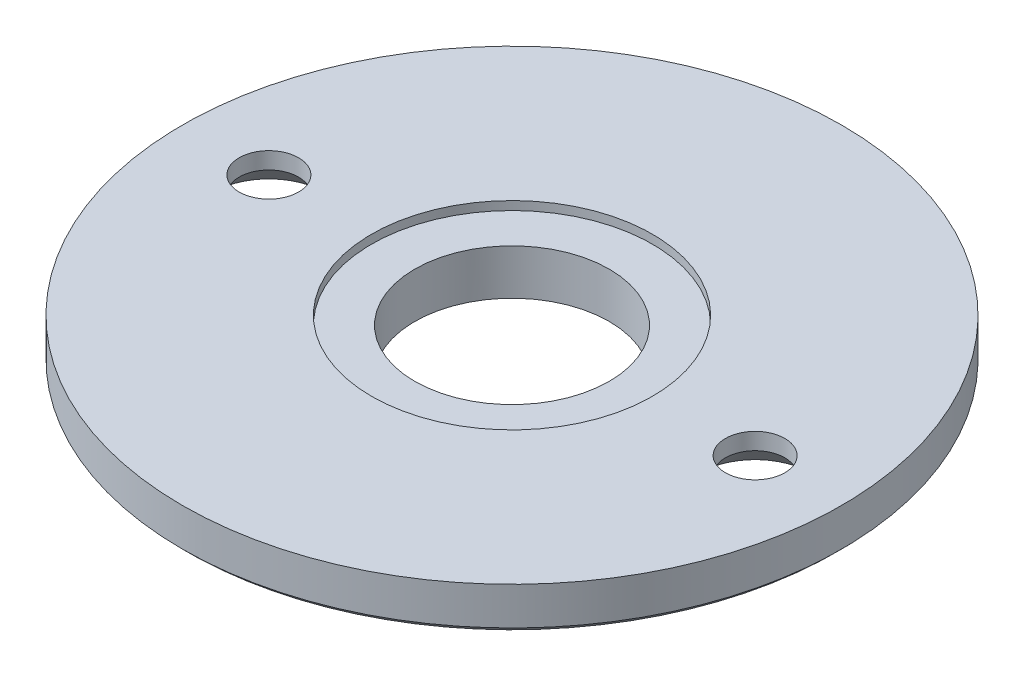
ISO-10303-21;
HEADER;
FILE_DESCRIPTION(('STEP AP214'),'2;1');
FILE_NAME('part.step','',(''),(''),'','','');
FILE_SCHEMA(('AUTOMOTIVE_DESIGN { 1 0 10303 214 1 1 1 1 }'));
ENDSEC;
DATA;
#1=APPLICATION_CONTEXT('core data for automotive mechanical design processes');
#2=APPLICATION_PROTOCOL_DEFINITION('international standard','automotive_design',2000,#1);
#3=PRODUCT_CONTEXT('',#1,'mechanical');
#4=PRODUCT('Part','Part','',(#3));
#5=PRODUCT_RELATED_PRODUCT_CATEGORY('part','',(#4));
#6=PRODUCT_DEFINITION_FORMATION('','',#4);
#7=PRODUCT_DEFINITION_CONTEXT('part definition',#1,'design');
#8=PRODUCT_DEFINITION('design','',#6,#7);
#9=PRODUCT_DEFINITION_SHAPE('','',#8);
#10=(LENGTH_UNIT() NAMED_UNIT(*) SI_UNIT(.MILLI.,.METRE.));
#11=(NAMED_UNIT(*) PLANE_ANGLE_UNIT() SI_UNIT($,.RADIAN.));
#12=(NAMED_UNIT(*) SI_UNIT($,.STERADIAN.) SOLID_ANGLE_UNIT());
#13=UNCERTAINTY_MEASURE_WITH_UNIT(LENGTH_MEASURE(1.E-05),#10,'distance_accuracy_value','');
#14=(GEOMETRIC_REPRESENTATION_CONTEXT(3) GLOBAL_UNCERTAINTY_ASSIGNED_CONTEXT((#13)) GLOBAL_UNIT_ASSIGNED_CONTEXT((#10,
#11,#12)) REPRESENTATION_CONTEXT('',''));
#15=CARTESIAN_POINT('',(0.,0.,0.));
#16=DIRECTION('',(0.,0.,1.));
#17=DIRECTION('',(1.,0.,0.));
#18=AXIS2_PLACEMENT_3D('',#15,#16,#17);
#19=CARTESIAN_POINT('',(0.,-5.,0.));
#20=DIRECTION('',(0.,1.,0.));
#21=DIRECTION('',(0.,0.,1.));
#22=AXIS2_PLACEMENT_3D('',#19,#20,#21);
#23=CYLINDRICAL_SURFACE('',#22,30.5);
#24=CARTESIAN_POINT('',(0.,-3.49999999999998,0.));
#25=DIRECTION('',(0.,-1.,0.));
#26=DIRECTION('',(0.,0.,-1.));
#27=AXIS2_PLACEMENT_3D('',#24,#25,#26);
#28=CIRCLE('',#27,30.5);
#29=CARTESIAN_POINT('',(0.,-3.49999999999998,-30.5));
#30=VERTEX_POINT('',#29);
#31=EDGE_CURVE('E209',#30,#30,#28,.F.);
#32=ORIENTED_EDGE('',*,*,#31,.T.);
#33=EDGE_LOOP('',(#32));
#34=FACE_BOUND('',#33,.T.);
#35=CARTESIAN_POINT('',(0.,0.,0.));
#36=DIRECTION('',(0.,1.,0.));
#37=DIRECTION('',(0.,0.,1.));
#38=AXIS2_PLACEMENT_3D('',#35,#36,#37);
#39=CIRCLE('',#38,30.5);
#40=CARTESIAN_POINT('',(0.,0.,30.5));
#41=VERTEX_POINT('',#40);
#42=EDGE_CURVE('E221',#41,#41,#39,.T.);
#43=ORIENTED_EDGE('',*,*,#42,.F.);
#44=EDGE_LOOP('',(#43));
#45=FACE_BOUND('',#44,.T.);
#46=ADVANCED_FACE('F201',(#34,#45),#23,.T.);
#47=CARTESIAN_POINT('',(0.,-5.,0.));
#48=DIRECTION('',(0.,1.,0.));
#49=DIRECTION('',(0.,0.,1.));
#50=AXIS2_PLACEMENT_3D('',#47,#48,#49);
#51=PLANE('',#50);
#52=CARTESIAN_POINT('',(0.,-5.,0.));
#53=DIRECTION('',(0.,-1.,0.));
#54=DIRECTION('',(0.,0.,-1.));
#55=AXIS2_PLACEMENT_3D('',#52,#53,#54);
#56=CIRCLE('',#55,9.);
#57=CARTESIAN_POINT('',(0.,-5.,-9.));
#58=VERTEX_POINT('',#57);
#59=EDGE_CURVE('E251',#58,#58,#56,.T.);
#60=ORIENTED_EDGE('',*,*,#59,.F.);
#61=EDGE_LOOP('',(#60));
#62=FACE_BOUND('',#61,.T.);
#63=CARTESIAN_POINT('',(0.,-5.,0.));
#64=DIRECTION('',(0.,1.,0.));
#65=DIRECTION('',(0.,0.,1.));
#66=AXIS2_PLACEMENT_3D('',#63,#64,#65);
#67=CIRCLE('',#66,15.5);
#68=CARTESIAN_POINT('',(0.,-5.,15.5));
#69=VERTEX_POINT('',#68);
#70=EDGE_CURVE('E218',#69,#69,#67,.F.);
#71=ORIENTED_EDGE('',*,*,#70,.T.);
#72=EDGE_LOOP('',(#71));
#73=FACE_BOUND('',#72,.T.);
#74=ADVANCED_FACE('F276',(#62,#73),#51,.F.);
#75=CARTESIAN_POINT('',(0.,0.,0.));
#76=DIRECTION('',(0.,1.,0.));
#77=DIRECTION('',(0.,0.,1.));
#78=AXIS2_PLACEMENT_3D('',#75,#76,#77);
#79=PLANE('',#78);
#80=CARTESIAN_POINT('',(22.5,0.,0.));
#81=DIRECTION('',(0.,1.,0.));
#82=DIRECTION('',(0.,0.,1.));
#83=AXIS2_PLACEMENT_3D('',#80,#81,#82);
#84=CIRCLE('',#83,2.75);
#85=CARTESIAN_POINT('',(22.5,0.,2.75));
#86=VERTEX_POINT('',#85);
#87=EDGE_CURVE('E222',#86,#86,#84,.T.);
#88=ORIENTED_EDGE('',*,*,#87,.F.);
#89=EDGE_LOOP('',(#88));
#90=FACE_BOUND('',#89,.T.);
#91=CARTESIAN_POINT('',(-22.5,0.,0.));
#92=DIRECTION('',(0.,1.,0.));
#93=DIRECTION('',(0.,0.,1.));
#94=AXIS2_PLACEMENT_3D('',#91,#92,#93);
#95=CIRCLE('',#94,2.75);
#96=CARTESIAN_POINT('',(-22.5,0.,2.75));
#97=VERTEX_POINT('',#96);
#98=EDGE_CURVE('E227',#97,#97,#95,.T.);
#99=ORIENTED_EDGE('',*,*,#98,.F.);
#100=EDGE_LOOP('',(#99));
#101=FACE_BOUND('',#100,.T.);
#102=CARTESIAN_POINT('',(0.,0.,0.));
#103=DIRECTION('',(0.,1.,0.));
#104=DIRECTION('',(0.,0.,1.));
#105=AXIS2_PLACEMENT_3D('',#102,#103,#104);
#106=CIRCLE('',#105,13.);
#107=CARTESIAN_POINT('',(0.,0.,13.));
#108=VERTEX_POINT('',#107);
#109=EDGE_CURVE('E235',#108,#108,#106,.T.);
#110=ORIENTED_EDGE('',*,*,#109,.F.);
#111=EDGE_LOOP('',(#110));
#112=FACE_BOUND('',#111,.T.);
#113=ORIENTED_EDGE('',*,*,#42,.T.);
#114=EDGE_LOOP('',(#113));
#115=FACE_BOUND('',#114,.T.);
#116=ADVANCED_FACE('F270',(#90,#101,#112,#115),#79,.T.);
#117=CARTESIAN_POINT('',(0.,-0.8,0.));
#118=DIRECTION('',(0.,1.,0.));
#119=DIRECTION('',(0.,0.,1.));
#120=AXIS2_PLACEMENT_3D('',#117,#118,#119);
#121=CYLINDRICAL_SURFACE('',#120,13.);
#122=CARTESIAN_POINT('',(0.,-0.8,0.));
#123=DIRECTION('',(0.,1.,0.));
#124=DIRECTION('',(0.,0.,1.));
#125=AXIS2_PLACEMENT_3D('',#122,#123,#124);
#126=CIRCLE('',#125,13.);
#127=CARTESIAN_POINT('',(0.,-0.8,13.));
#128=VERTEX_POINT('',#127);
#129=EDGE_CURVE('E234',#128,#128,#126,.T.);
#130=ORIENTED_EDGE('',*,*,#129,.F.);
#131=EDGE_LOOP('',(#130));
#132=FACE_BOUND('',#131,.T.);
#133=ORIENTED_EDGE('',*,*,#109,.T.);
#134=EDGE_LOOP('',(#133));
#135=FACE_BOUND('',#134,.T.);
#136=ADVANCED_FACE('F264',(#132,#135),#121,.F.);
#137=CARTESIAN_POINT('',(0.,-0.8,0.));
#138=DIRECTION('',(0.,1.,0.));
#139=DIRECTION('',(0.,0.,1.));
#140=AXIS2_PLACEMENT_3D('',#137,#138,#139);
#141=PLANE('',#140);
#142=CARTESIAN_POINT('',(0.,-0.8,0.));
#143=DIRECTION('',(0.,1.,0.));
#144=DIRECTION('',(0.,0.,1.));
#145=AXIS2_PLACEMENT_3D('',#142,#143,#144);
#146=CIRCLE('',#145,9.);
#147=CARTESIAN_POINT('',(0.,-0.8,9.));
#148=VERTEX_POINT('',#147);
#149=EDGE_CURVE('E205',#148,#148,#146,.T.);
#150=ORIENTED_EDGE('',*,*,#149,.F.);
#151=EDGE_LOOP('',(#150));
#152=FACE_BOUND('',#151,.T.);
#153=ORIENTED_EDGE('',*,*,#129,.T.);
#154=EDGE_LOOP('',(#153));
#155=FACE_BOUND('',#154,.T.);
#156=ADVANCED_FACE('F260',(#152,#155),#141,.T.);
#157=CARTESIAN_POINT('',(0.,-4.,0.));
#158=DIRECTION('',(0.,-1.,0.));
#159=DIRECTION('',(0.,0.,-1.));
#160=AXIS2_PLACEMENT_3D('',#157,#158,#159);
#161=PLANE('',#160);
#162=CARTESIAN_POINT('',(0.,-4.,0.));
#163=DIRECTION('',(0.,-1.,0.));
#164=DIRECTION('',(0.,0.,-1.));
#165=AXIS2_PLACEMENT_3D('',#162,#163,#164);
#166=CIRCLE('',#165,30.);
#167=CARTESIAN_POINT('',(0.,-4.,-30.));
#168=VERTEX_POINT('',#167);
#169=EDGE_CURVE('E12',#168,#168,#166,.T.);
#170=ORIENTED_EDGE('',*,*,#169,.T.);
#171=EDGE_LOOP('',(#170));
#172=FACE_BOUND('',#171,.T.);
#173=CARTESIAN_POINT('',(22.5,-4.,0.));
#174=DIRECTION('',(0.,-1.,0.));
#175=DIRECTION('',(0.,0.,-1.));
#176=AXIS2_PLACEMENT_3D('',#173,#174,#175);
#177=CIRCLE('',#176,5.2);
#178=CARTESIAN_POINT('',(22.5,-4.,-5.2));
#179=VERTEX_POINT('',#178);
#180=EDGE_CURVE('E248',#179,#179,#177,.T.);
#181=ORIENTED_EDGE('',*,*,#180,.F.);
#182=EDGE_LOOP('',(#181));
#183=FACE_BOUND('',#182,.T.);
#184=CARTESIAN_POINT('',(-22.5,-4.,0.));
#185=DIRECTION('',(0.,-1.,0.));
#186=DIRECTION('',(0.,0.,-1.));
#187=AXIS2_PLACEMENT_3D('',#184,#185,#186);
#188=CIRCLE('',#187,5.2);
#189=CARTESIAN_POINT('',(-22.5,-4.,-5.2));
#190=VERTEX_POINT('',#189);
#191=EDGE_CURVE('E225',#190,#190,#188,.T.);
#192=ORIENTED_EDGE('',*,*,#191,.F.);
#193=EDGE_LOOP('',(#192));
#194=FACE_BOUND('',#193,.T.);
#195=CARTESIAN_POINT('',(0.,-4.,0.));
#196=DIRECTION('',(0.,-1.,0.));
#197=DIRECTION('',(0.,0.,-1.));
#198=AXIS2_PLACEMENT_3D('',#195,#196,#197);
#199=CIRCLE('',#198,16.);
#200=CARTESIAN_POINT('',(0.,-4.,-16.));
#201=VERTEX_POINT('',#200);
#202=EDGE_CURVE('E230',#201,#201,#199,.T.);
#203=ORIENTED_EDGE('',*,*,#202,.F.);
#204=EDGE_LOOP('',(#203));
#205=FACE_BOUND('',#204,.T.);
#206=ADVANCED_FACE('F263',(#172,#183,#194,#205),#161,.T.);
#207=CARTESIAN_POINT('',(0.,-4.,0.));
#208=DIRECTION('',(0.,-1.,0.));
#209=DIRECTION('',(0.,0.,-1.));
#210=AXIS2_PLACEMENT_3D('',#207,#208,#209);
#211=CYLINDRICAL_SURFACE('',#210,16.);
#212=CARTESIAN_POINT('',(0.,-4.49999999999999,0.));
#213=DIRECTION('',(0.,1.,0.));
#214=DIRECTION('',(0.,0.,1.));
#215=AXIS2_PLACEMENT_3D('',#212,#213,#214);
#216=CIRCLE('',#215,16.);
#217=CARTESIAN_POINT('',(0.,-4.49999999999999,16.));
#218=VERTEX_POINT('',#217);
#219=EDGE_CURVE('E213',#218,#218,#216,.T.);
#220=ORIENTED_EDGE('',*,*,#219,.T.);
#221=EDGE_LOOP('',(#220));
#222=FACE_BOUND('',#221,.T.);
#223=ORIENTED_EDGE('',*,*,#202,.T.);
#224=EDGE_LOOP('',(#223));
#225=FACE_BOUND('',#224,.T.);
#226=ADVANCED_FACE('F307',(#222,#225),#211,.T.);
#227=CARTESIAN_POINT('',(-22.5,-4.,0.));
#228=DIRECTION('',(0.,-1.,0.));
#229=DIRECTION('',(0.,0.,-1.));
#230=AXIS2_PLACEMENT_3D('',#227,#228,#229);
#231=CYLINDRICAL_SURFACE('',#230,2.75);
#232=ORIENTED_EDGE('',*,*,#98,.T.);
#233=EDGE_LOOP('',(#232));
#234=FACE_BOUND('',#233,.T.);
#235=CARTESIAN_POINT('',(-22.5,-1.55,0.));
#236=DIRECTION('',(0.,-1.,0.));
#237=DIRECTION('',(0.,0.,-1.));
#238=AXIS2_PLACEMENT_3D('',#235,#236,#237);
#239=CIRCLE('',#238,2.75);
#240=CARTESIAN_POINT('',(-22.5,-1.55,-2.75));
#241=VERTEX_POINT('',#240);
#242=EDGE_CURVE('E231',#241,#241,#239,.T.);
#243=ORIENTED_EDGE('',*,*,#242,.T.);
#244=EDGE_LOOP('',(#243));
#245=FACE_BOUND('',#244,.T.);
#246=ADVANCED_FACE('F310',(#234,#245),#231,.F.);
#247=CARTESIAN_POINT('',(-22.5,-4.,0.));
#248=DIRECTION('',(0.,-1.,0.));
#249=DIRECTION('',(0.,0.,-1.));
#250=AXIS2_PLACEMENT_3D('',#247,#248,#249);
#251=CONICAL_SURFACE('',#250,5.2,0.785398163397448);
#252=ORIENTED_EDGE('',*,*,#242,.F.);
#253=EDGE_LOOP('',(#252));
#254=FACE_BOUND('',#253,.T.);
#255=ORIENTED_EDGE('',*,*,#191,.T.);
#256=EDGE_LOOP('',(#255));
#257=FACE_BOUND('',#256,.T.);
#258=ADVANCED_FACE('F323',(#254,#257),#251,.F.);
#259=CARTESIAN_POINT('',(22.5,-4.,0.));
#260=DIRECTION('',(0.,-1.,0.));
#261=DIRECTION('',(0.,0.,-1.));
#262=AXIS2_PLACEMENT_3D('',#259,#260,#261);
#263=CYLINDRICAL_SURFACE('',#262,2.75);
#264=ORIENTED_EDGE('',*,*,#87,.T.);
#265=EDGE_LOOP('',(#264));
#266=FACE_BOUND('',#265,.T.);
#267=CARTESIAN_POINT('',(22.5,-1.55,0.));
#268=DIRECTION('',(0.,-1.,0.));
#269=DIRECTION('',(0.,0.,-1.));
#270=AXIS2_PLACEMENT_3D('',#267,#268,#269);
#271=CIRCLE('',#270,2.75);
#272=CARTESIAN_POINT('',(22.5,-1.55,-2.75));
#273=VERTEX_POINT('',#272);
#274=EDGE_CURVE('E226',#273,#273,#271,.T.);
#275=ORIENTED_EDGE('',*,*,#274,.T.);
#276=EDGE_LOOP('',(#275));
#277=FACE_BOUND('',#276,.T.);
#278=ADVANCED_FACE('F299',(#266,#277),#263,.F.);
#279=CARTESIAN_POINT('',(22.5,-4.,0.));
#280=DIRECTION('',(0.,-1.,0.));
#281=DIRECTION('',(0.,0.,-1.));
#282=AXIS2_PLACEMENT_3D('',#279,#280,#281);
#283=CONICAL_SURFACE('',#282,5.2,0.785398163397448);
#284=ORIENTED_EDGE('',*,*,#274,.F.);
#285=EDGE_LOOP('',(#284));
#286=FACE_BOUND('',#285,.T.);
#287=ORIENTED_EDGE('',*,*,#180,.T.);
#288=EDGE_LOOP('',(#287));
#289=FACE_BOUND('',#288,.T.);
#290=ADVANCED_FACE('F292',(#286,#289),#283,.F.);
#291=CARTESIAN_POINT('',(0.,-5.,0.));
#292=DIRECTION('',(0.,1.,0.));
#293=DIRECTION('',(0.,0.,1.));
#294=AXIS2_PLACEMENT_3D('',#291,#292,#293);
#295=CONICAL_SURFACE('',#294,15.5,0.785398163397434);
#296=ORIENTED_EDGE('',*,*,#219,.F.);
#297=EDGE_LOOP('',(#296));
#298=FACE_BOUND('',#297,.T.);
#299=ORIENTED_EDGE('',*,*,#70,.F.);
#300=EDGE_LOOP('',(#299));
#301=FACE_BOUND('',#300,.T.);
#302=ADVANCED_FACE('F290',(#298,#301),#295,.T.);
#303=CARTESIAN_POINT('',(0.,-3.49999999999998,0.));
#304=DIRECTION('',(0.,1.,0.));
#305=DIRECTION('',(0.,0.,1.));
#306=AXIS2_PLACEMENT_3D('',#303,#304,#305);
#307=CONICAL_SURFACE('',#306,30.5,0.785398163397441);
#308=ORIENTED_EDGE('',*,*,#169,.F.);
#309=EDGE_LOOP('',(#308));
#310=FACE_BOUND('',#309,.T.);
#311=ORIENTED_EDGE('',*,*,#31,.F.);
#312=EDGE_LOOP('',(#311));
#313=FACE_BOUND('',#312,.T.);
#314=ADVANCED_FACE('F203',(#310,#313),#307,.T.);
#315=CARTESIAN_POINT('',(0.,0.,0.));
#316=DIRECTION('',(0.,-1.,0.));
#317=DIRECTION('',(0.,0.,-1.));
#318=AXIS2_PLACEMENT_3D('',#315,#316,#317);
#319=CYLINDRICAL_SURFACE('',#318,9.);
#320=ORIENTED_EDGE('',*,*,#149,.T.);
#321=EDGE_LOOP('',(#320));
#322=FACE_BOUND('',#321,.T.);
#323=ORIENTED_EDGE('',*,*,#59,.T.);
#324=EDGE_LOOP('',(#323));
#325=FACE_BOUND('',#324,.T.);
#326=ADVANCED_FACE('F258',(#322,#325),#319,.F.);
#327=CLOSED_SHELL('',(#46,#74,#116,#136,#156,#206,#226,#246,#258,#278,#290,#302,#314,#326));
#328=MANIFOLD_SOLID_BREP('B2',#327);
#329=ADVANCED_BREP_SHAPE_REPRESENTATION('',(#18,#328),#14);
#330=SHAPE_DEFINITION_REPRESENTATION(#9,#329);
ENDSEC;
END-ISO-10303-21;
